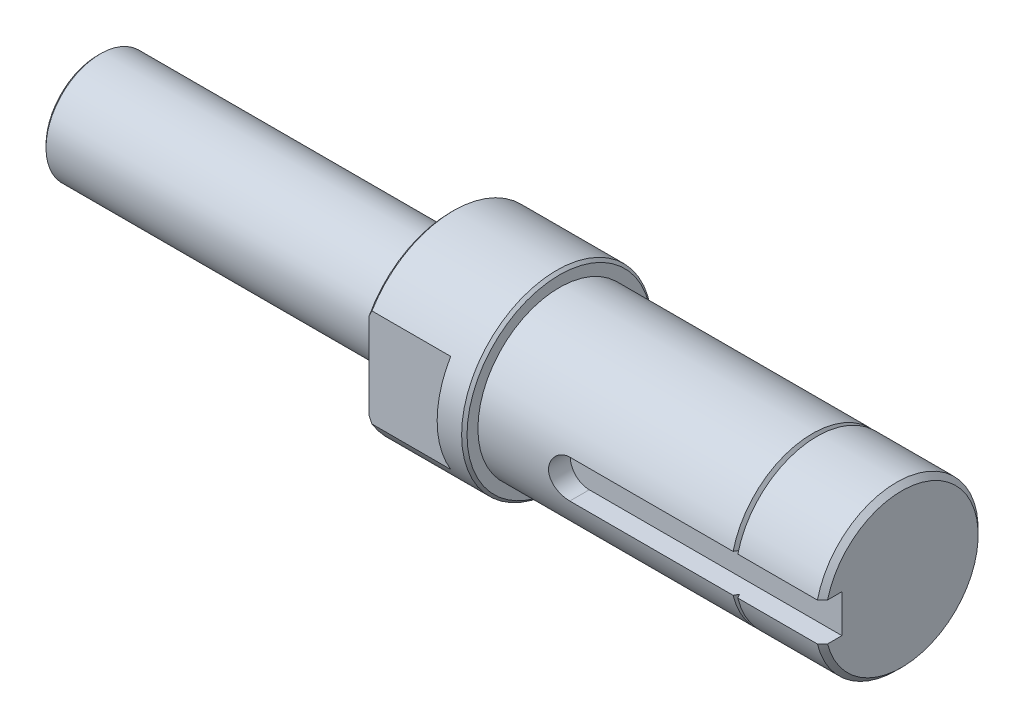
ISO-10303-21;
HEADER;
FILE_DESCRIPTION(('STEP AP214'),'2;1');
FILE_NAME('part.step','',(''),(''),'','','');
FILE_SCHEMA(('AUTOMOTIVE_DESIGN { 1 0 10303 214 1 1 1 1 }'));
ENDSEC;
DATA;
#1=APPLICATION_CONTEXT('core data for automotive mechanical design processes');
#2=APPLICATION_PROTOCOL_DEFINITION('international standard','automotive_design',2000,#1);
#3=PRODUCT_CONTEXT('',#1,'mechanical');
#4=PRODUCT('Part','Part','',(#3));
#5=PRODUCT_RELATED_PRODUCT_CATEGORY('part','',(#4));
#6=PRODUCT_DEFINITION_FORMATION('','',#4);
#7=PRODUCT_DEFINITION_CONTEXT('part definition',#1,'design');
#8=PRODUCT_DEFINITION('design','',#6,#7);
#9=PRODUCT_DEFINITION_SHAPE('','',#8);
#10=(LENGTH_UNIT() NAMED_UNIT(*) SI_UNIT(.MILLI.,.METRE.));
#11=(NAMED_UNIT(*) PLANE_ANGLE_UNIT() SI_UNIT($,.RADIAN.));
#12=(NAMED_UNIT(*) SI_UNIT($,.STERADIAN.) SOLID_ANGLE_UNIT());
#13=UNCERTAINTY_MEASURE_WITH_UNIT(LENGTH_MEASURE(1.E-05),#10,'distance_accuracy_value','');
#14=(GEOMETRIC_REPRESENTATION_CONTEXT(3) GLOBAL_UNCERTAINTY_ASSIGNED_CONTEXT((#13)) GLOBAL_UNIT_ASSIGNED_CONTEXT((#10,
#11,#12)) REPRESENTATION_CONTEXT('',''));
#15=CARTESIAN_POINT('',(0.,0.,0.));
#16=DIRECTION('',(0.,0.,1.));
#17=DIRECTION('',(1.,0.,0.));
#18=AXIS2_PLACEMENT_3D('',#15,#16,#17);
#19=CARTESIAN_POINT('',(83.,0.,0.));
#20=DIRECTION('',(-1.,0.,0.));
#21=DIRECTION('',(0.,0.,1.));
#22=AXIS2_PLACEMENT_3D('',#19,#20,#21);
#23=CYLINDRICAL_SURFACE('',#22,15.);
#24=CARTESIAN_POINT('',(20.,0.,0.));
#25=DIRECTION('',(-1.,0.,0.));
#26=DIRECTION('',(0.,0.,1.));
#27=AXIS2_PLACEMENT_3D('',#24,#25,#26);
#28=CIRCLE('',#27,15.);
#29=CARTESIAN_POINT('',(20.,0.,15.));
#30=VERTEX_POINT('',#29);
#31=EDGE_CURVE('E219',#30,#30,#28,.T.);
#32=ORIENTED_EDGE('',*,*,#31,.F.);
#33=EDGE_LOOP('',(#32));
#34=FACE_BOUND('',#33,.T.);
#35=CARTESIAN_POINT('',(66.5669872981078,0.,0.));
#36=DIRECTION('',(-1.,0.,0.));
#37=DIRECTION('',(0.,0.,1.));
#38=AXIS2_PLACEMENT_3D('',#35,#36,#37);
#39=CIRCLE('',#38,15.);
#40=CARTESIAN_POINT('',(66.5669872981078,3.5,14.5859521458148));
#41=VERTEX_POINT('',#40);
#42=CARTESIAN_POINT('',(66.5669872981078,-3.5,14.5859521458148));
#43=VERTEX_POINT('',#42);
#44=EDGE_CURVE('E182',#41,#43,#39,.T.);
#45=ORIENTED_EDGE('',*,*,#44,.T.);
#46=DIRECTION('',(-1.,0.,0.));
#47=VECTOR('',#46,1.);
#48=CARTESIAN_POINT('',(83.,-3.5,14.5859521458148));
#49=LINE('',#48,#47);
#50=CARTESIAN_POINT('',(36.5,-3.5,14.5859521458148));
#51=VERTEX_POINT('',#50);
#52=EDGE_CURVE('E291',#43,#51,#49,.T.);
#53=ORIENTED_EDGE('',*,*,#52,.T.);
#54=CARTESIAN_POINT('',(36.5,-3.5,14.5859521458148));
#55=CARTESIAN_POINT('',(36.4029930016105,-3.50001098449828,14.5859421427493));
#56=CARTESIAN_POINT('',(36.3059923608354,-3.4959671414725,14.5869196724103));
#57=CARTESIAN_POINT('',(36.1127121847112,-3.47985507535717,14.590775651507));
#58=CARTESIAN_POINT('',(36.016432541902,-3.46778807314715,14.5936538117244));
#59=CARTESIAN_POINT('',(35.8254460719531,-3.43574398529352,14.6012300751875));
#60=CARTESIAN_POINT('',(35.7307367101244,-3.41578127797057,14.6059248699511));
#61=CARTESIAN_POINT('',(35.5434088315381,-3.36812809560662,14.6169869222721));
#62=CARTESIAN_POINT('',(35.4507903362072,-3.34043754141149,14.6233541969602));
#63=CARTESIAN_POINT('',(35.1770439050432,-3.24606757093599,14.6447008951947));
#64=CARTESIAN_POINT('',(34.9998478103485,-3.1680598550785,14.6619327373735));
#65=CARTESIAN_POINT('',(34.6611081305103,-2.98423929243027,14.7004448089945));
#66=CARTESIAN_POINT('',(34.4995678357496,-2.87842061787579,14.7217258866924));
#67=CARTESIAN_POINT('',(34.1935575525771,-2.63980745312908,14.7663931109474));
#68=CARTESIAN_POINT('',(34.0494274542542,-2.50658184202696,14.7898090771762));
#69=CARTESIAN_POINT('',(33.7853394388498,-2.21786171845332,14.8358492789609));
#70=CARTESIAN_POINT('',(33.6653853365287,-2.06236369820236,14.8584733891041));
#71=CARTESIAN_POINT('',(33.4516813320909,-1.73119672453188,14.9007084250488));
#72=CARTESIAN_POINT('',(33.3582643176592,-1.55530745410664,14.9202797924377));
#73=CARTESIAN_POINT('',(33.2024516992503,-1.18980124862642,14.9538625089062));
#74=CARTESIAN_POINT('',(33.1400505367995,-1.00018678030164,14.9678748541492));
#75=CARTESIAN_POINT('',(33.0491203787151,-0.616173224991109,14.9885500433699));
#76=CARTESIAN_POINT('',(33.0200102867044,-0.421918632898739,14.9953388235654));
#77=CARTESIAN_POINT('',(32.9946684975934,-0.0311680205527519,15.0012395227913));
#78=CARTESIAN_POINT('',(32.9984332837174,0.16532775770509,15.0003522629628));
#79=CARTESIAN_POINT('',(33.0383095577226,0.550956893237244,14.9910956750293));
#80=CARTESIAN_POINT('',(33.0737935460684,0.740159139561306,14.9828714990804));
#81=CARTESIAN_POINT('',(33.1750965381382,1.10984488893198,14.9600322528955));
#82=CARTESIAN_POINT('',(33.2409167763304,1.2903280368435,14.9454169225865));
#83=CARTESIAN_POINT('',(33.4015591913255,1.639158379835,14.9112090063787));
#84=CARTESIAN_POINT('',(33.4966130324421,1.8073948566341,14.891576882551));
#85=CARTESIAN_POINT('',(33.7128447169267,2.12574898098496,14.8494785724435));
#86=CARTESIAN_POINT('',(33.8340258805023,2.27586432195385,14.8270120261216));
#87=CARTESIAN_POINT('',(34.1024615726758,2.55744307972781,14.7810806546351));
#88=CARTESIAN_POINT('',(34.2502624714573,2.68838455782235,14.7576047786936));
#89=CARTESIAN_POINT('',(34.5659741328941,2.92375619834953,14.7127850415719));
#90=CARTESIAN_POINT('',(34.7338903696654,3.02817911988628,14.6914417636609));
#91=CARTESIAN_POINT('',(35.0862092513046,3.20786398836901,14.6532641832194));
#92=CARTESIAN_POINT('',(35.2706796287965,3.2829987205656,14.6364496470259));
#93=CARTESIAN_POINT('',(35.554926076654,3.37145680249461,14.6162291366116));
#94=CARTESIAN_POINT('',(35.6509159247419,3.39690005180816,14.6103230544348));
#95=CARTESIAN_POINT('',(35.8447889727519,3.43955343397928,14.6003411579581));
#96=CARTESIAN_POINT('',(35.9426712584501,3.45676744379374,14.5962644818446));
#97=CARTESIAN_POINT('',(36.1172059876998,3.47985101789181,14.590776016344));
#98=CARTESIAN_POINT('',(36.1936287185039,3.48740952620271,14.5889691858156));
#99=CARTESIAN_POINT('',(36.3466980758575,3.49748134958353,14.586556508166));
#100=CARTESIAN_POINT('',(36.4233441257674,3.50000295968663,14.5859486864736));
#101=CARTESIAN_POINT('',(36.5,3.5,14.5859521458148));
#102=B_SPLINE_CURVE_WITH_KNOTS('',3,(#54,#55,#56,#57,#58,#59,#60,#61,#62,#63,#64,#65,#66,#67,
#68,#69,#70,#71,#72,#73,#74,#75,#76,#77,#78,#79,#80,#81,#82,#83,#84,#85,#86,#87,#88,#89,#90,#91,
#92,#93,#94,#95,#96,#97,#98,#99,#100,#101),.UNSPECIFIED.,.F.,.F.,(4,2,2,2,2,2,2,2,2,2,2,2,2,2,2,
2,2,2,2,2,2,2,2,4),(0.,0.290920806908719,0.581797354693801,0.872146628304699,1.16249887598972,
1.74267048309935,2.32296376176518,2.91319936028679,3.50352802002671,4.10096424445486,
4.69829336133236,5.28502883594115,5.87170154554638,6.44701886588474,7.02235959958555,
7.60238257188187,8.18247929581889,8.77622447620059,9.37013160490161,9.96659039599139,
10.2647254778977,10.5627199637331,10.7930041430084,11.0229087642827),.UNSPECIFIED.);
#103=CARTESIAN_POINT('',(36.5,3.5,14.5859521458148));
#104=VERTEX_POINT('',#103);
#105=EDGE_CURVE('E253',#51,#104,#102,.T.);
#106=ORIENTED_EDGE('',*,*,#105,.T.);
#107=DIRECTION('',(-1.,0.,0.));
#108=VECTOR('',#107,1.);
#109=CARTESIAN_POINT('',(83.,3.5,14.5859521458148));
#110=LINE('',#109,#108);
#111=EDGE_CURVE('E198',#104,#41,#110,.F.);
#112=ORIENTED_EDGE('',*,*,#111,.T.);
#113=EDGE_LOOP('',(#45,#53,#106,#112));
#114=FACE_BOUND('',#113,.T.);
#115=ADVANCED_FACE('F40',(#34,#114),#23,.T.);
#116=CARTESIAN_POINT('',(67.4330127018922,0.,0.));
#117=DIRECTION('',(-1.,0.,0.));
#118=DIRECTION('',(0.,0.,1.));
#119=AXIS2_PLACEMENT_3D('',#116,#117,#118);
#120=CIRCLE('',#119,15.);
#121=CARTESIAN_POINT('',(67.4330127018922,3.5,14.5859521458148));
#122=VERTEX_POINT('',#121);
#123=CARTESIAN_POINT('',(67.4330127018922,-3.5,14.5859521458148));
#124=VERTEX_POINT('',#123);
#125=EDGE_CURVE('E64',#122,#124,#120,.T.);
#126=ORIENTED_EDGE('',*,*,#125,.F.);
#127=CARTESIAN_POINT('',(82.08,3.5,14.5859521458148));
#128=VERTEX_POINT('',#127);
#129=EDGE_CURVE('E188',#122,#128,#110,.F.);
#130=ORIENTED_EDGE('',*,*,#129,.T.);
#131=CARTESIAN_POINT('',(82.08,0.,0.));
#132=DIRECTION('',(-1.,0.,0.));
#133=DIRECTION('',(0.,0.,1.));
#134=AXIS2_PLACEMENT_3D('',#131,#132,#133);
#135=CIRCLE('',#134,15.);
#136=CARTESIAN_POINT('',(82.08,-3.5,14.5859521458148));
#137=VERTEX_POINT('',#136);
#138=EDGE_CURVE('E216',#128,#137,#135,.T.);
#139=ORIENTED_EDGE('',*,*,#138,.T.);
#140=EDGE_CURVE('E190',#137,#124,#49,.T.);
#141=ORIENTED_EDGE('',*,*,#140,.T.);
#142=EDGE_LOOP('',(#126,#130,#139,#141));
#143=FACE_BOUND('',#142,.T.);
#144=ADVANCED_FACE('F186',(#143),#23,.T.);
#145=CARTESIAN_POINT('',(83.,3.5,11.));
#146=DIRECTION('',(0.,1.,0.));
#147=DIRECTION('',(0.,0.,1.));
#148=AXIS2_PLACEMENT_3D('',#145,#146,#147);
#149=PLANE('',#148);
#150=CARTESIAN_POINT('',(63.5703695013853,3.5,19.8846167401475));
#151=CARTESIAN_POINT('',(63.8415767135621,3.5,19.4076352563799));
#152=CARTESIAN_POINT('',(64.1125752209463,3.5,18.9305348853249));
#153=CARTESIAN_POINT('',(64.6540169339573,3.5,17.9760198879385));
#154=CARTESIAN_POINT('',(64.9244601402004,3.5,17.4986052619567));
#155=CARTESIAN_POINT('',(65.4646444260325,3.5,16.5434010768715));
#156=CARTESIAN_POINT('',(65.7343855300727,3.5,16.0656115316));
#157=CARTESIAN_POINT('',(66.2729724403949,3.5,15.1095264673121));
#158=CARTESIAN_POINT('',(66.5418182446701,3.5,14.6312309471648));
#159=CARTESIAN_POINT('',(67.0783371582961,3.5,13.6739580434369));
#160=CARTESIAN_POINT('',(67.346010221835,3.5,13.1949806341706));
#161=CARTESIAN_POINT('',(67.8797530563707,3.5,12.236135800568));
#162=CARTESIAN_POINT('',(68.1458228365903,3.5,11.7562683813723));
#163=CARTESIAN_POINT('',(68.5432371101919,3.5,11.0355229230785));
#164=CARTESIAN_POINT('',(68.6754293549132,3.5,10.7951123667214));
#165=CARTESIAN_POINT('',(68.9391277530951,3.5,10.3139156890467));
#166=CARTESIAN_POINT('',(69.0706339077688,3.5,10.073129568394));
#167=CARTESIAN_POINT('',(69.3328189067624,3.5,9.59110095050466));
#168=CARTESIAN_POINT('',(69.4634977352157,3.5,9.34985844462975));
#169=CARTESIAN_POINT('',(69.7238185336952,3.5,8.86681293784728));
#170=CARTESIAN_POINT('',(69.8534604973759,3.5,8.62500993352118));
#171=CARTESIAN_POINT('',(69.982479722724,3.5,8.38287379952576));
#172=B_SPLINE_CURVE_WITH_KNOTS('',3,(#150,#151,#152,#153,#154,#155,#156,#157,#158,#159,#160,
#161,#162,#163,#164,#165,#166,#167,#168,#169,#170,#171),.UNSPECIFIED.,.F.,.F.,(4,2,2,2,2,2,2,2,
2,2,4),(0.,1.6460810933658,3.29216035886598,4.93818151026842,6.58420634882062,8.23029492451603,
9.87637402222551,10.6994455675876,11.5225156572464,12.3456014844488,13.1686923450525),.UNSPECIFIED.);
#173=CARTESIAN_POINT('',(67.,3.5,13.8134897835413));
#174=VERTEX_POINT('',#173);
#175=EDGE_CURVE('E181',#41,#174,#172,.T.);
#176=ORIENTED_EDGE('',*,*,#175,.F.);
#177=ORIENTED_EDGE('',*,*,#111,.F.);
#178=DIRECTION('',(0.,0.,1.));
#179=VECTOR('',#178,1.);
#180=CARTESIAN_POINT('',(36.5,3.5,11.));
#181=LINE('',#180,#179);
#182=CARTESIAN_POINT('',(36.5,3.5,11.));
#183=VERTEX_POINT('',#182);
#184=EDGE_CURVE('E292',#183,#104,#181,.T.);
#185=ORIENTED_EDGE('',*,*,#184,.F.);
#186=DIRECTION('',(-1.,0.,0.));
#187=VECTOR('',#186,1.);
#188=CARTESIAN_POINT('',(83.,3.5,11.));
#189=LINE('',#188,#187);
#190=CARTESIAN_POINT('',(83.,3.5,11.));
#191=VERTEX_POINT('',#190);
#192=EDGE_CURVE('E314',#191,#183,#189,.T.);
#193=ORIENTED_EDGE('',*,*,#192,.F.);
#194=DIRECTION('',(0.,0.,1.));
#195=VECTOR('',#194,1.);
#196=CARTESIAN_POINT('',(83.,3.5,11.));
#197=LINE('',#196,#195);
#198=CARTESIAN_POINT('',(83.,3.5,13.6380497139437));
#199=VERTEX_POINT('',#198);
#200=EDGE_CURVE('E318',#191,#199,#197,.T.);
#201=ORIENTED_EDGE('',*,*,#200,.T.);
#202=CARTESIAN_POINT('',(77.4554523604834,3.5,19.3099163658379));
#203=CARTESIAN_POINT('',(77.9061440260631,3.5,18.8518655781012));
#204=CARTESIAN_POINT('',(78.3565916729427,3.5,18.3935742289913));
#205=CARTESIAN_POINT('',(79.2568372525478,3.5,17.4763554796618));
#206=CARTESIAN_POINT('',(79.706635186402,3.5,17.0174280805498));
#207=CARTESIAN_POINT('',(80.6053976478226,3.5,16.0988048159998));
#208=CARTESIAN_POINT('',(81.0543622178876,3.5,15.639108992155));
#209=CARTESIAN_POINT('',(81.951244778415,3.5,14.7186940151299));
#210=CARTESIAN_POINT('',(82.3991627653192,3.5,14.2579748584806));
#211=CARTESIAN_POINT('',(83.2936384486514,3.5,13.3351657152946));
#212=CARTESIAN_POINT('',(83.7401960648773,3.5,12.8730756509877));
#213=CARTESIAN_POINT('',(84.6314259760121,3.5,11.9470862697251));
#214=CARTESIAN_POINT('',(85.0760982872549,3.5,11.4831869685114));
#215=CARTESIAN_POINT('',(85.7411167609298,3.5,10.785415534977));
#216=CARTESIAN_POINT('',(85.9624643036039,3.5,10.5524978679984));
#217=CARTESIAN_POINT('',(86.4043451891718,3.5,10.0858923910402));
#218=CARTESIAN_POINT('',(86.6248785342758,3.5,9.85220458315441));
#219=CARTESIAN_POINT('',(87.0649625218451,3.5,9.38389188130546));
#220=CARTESIAN_POINT('',(87.2845131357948,3.5,9.14926696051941));
#221=CARTESIAN_POINT('',(87.7223692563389,3.5,8.67885448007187));
#222=CARTESIAN_POINT('',(87.9406747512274,3.5,8.44306690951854));
#223=CARTESIAN_POINT('',(88.1582276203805,3.5,8.20658408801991));
#224=B_SPLINE_CURVE_WITH_KNOTS('',3,(#202,#203,#204,#205,#206,#207,#208,#209,#210,#211,#212,
#213,#214,#215,#216,#217,#218,#219,#220,#221,#222,#223),.UNSPECIFIED.,.F.,.F.,(4,2,2,2,2,2,2,2,
2,2,4),(0.,1.92779746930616,3.85559158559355,5.78328453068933,7.71098402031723,9.63879504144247,
11.5665893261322,12.5305423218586,13.4944926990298,14.4584708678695,15.4224580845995),.UNSPECIFIED.);
#225=EDGE_CURVE('E195',#128,#199,#224,.T.);
#226=ORIENTED_EDGE('',*,*,#225,.F.);
#227=ORIENTED_EDGE('',*,*,#129,.F.);
#228=CARTESIAN_POINT('',(64.017520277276,3.5,8.38287379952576));
#229=CARTESIAN_POINT('',(64.1465395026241,3.5,8.62500993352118));
#230=CARTESIAN_POINT('',(64.2761814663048,3.5,8.86681293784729));
#231=CARTESIAN_POINT('',(64.5365022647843,3.5,9.34985844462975));
#232=CARTESIAN_POINT('',(64.6671810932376,3.5,9.59110095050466));
#233=CARTESIAN_POINT('',(64.9293660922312,3.5,10.073129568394));
#234=CARTESIAN_POINT('',(65.0608722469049,3.5,10.3139156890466));
#235=CARTESIAN_POINT('',(65.3245706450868,3.5,10.7951123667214));
#236=CARTESIAN_POINT('',(65.4567628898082,3.5,11.0355229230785));
#237=CARTESIAN_POINT('',(65.8541771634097,3.5,11.7562683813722));
#238=CARTESIAN_POINT('',(66.1202469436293,3.5,12.236135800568));
#239=CARTESIAN_POINT('',(66.653989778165,3.5,13.1949806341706));
#240=CARTESIAN_POINT('',(66.9216628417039,3.5,13.6739580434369));
#241=CARTESIAN_POINT('',(67.4581817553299,3.5,14.6312309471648));
#242=CARTESIAN_POINT('',(67.7270275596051,3.5,15.1095264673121));
#243=CARTESIAN_POINT('',(68.2656144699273,3.5,16.0656115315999));
#244=CARTESIAN_POINT('',(68.5353555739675,3.5,16.5434010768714));
#245=CARTESIAN_POINT('',(69.0755398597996,3.5,17.4986052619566));
#246=CARTESIAN_POINT('',(69.3459830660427,3.5,17.9760198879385));
#247=CARTESIAN_POINT('',(69.8874247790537,3.5,18.9305348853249));
#248=CARTESIAN_POINT('',(70.1584232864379,3.5,19.4076352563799));
#249=CARTESIAN_POINT('',(70.4296304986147,3.5,19.8846167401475));
#250=B_SPLINE_CURVE_WITH_KNOTS('',3,(#228,#229,#230,#231,#232,#233,#234,#235,#236,#237,#238,
#239,#240,#241,#242,#243,#244,#245,#246,#247,#248,#249),.UNSPECIFIED.,.F.,.F.,(4,2,2,2,2,2,2,2,
2,2,4),(0.,0.823090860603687,1.64617668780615,2.46924677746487,3.29231832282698,
4.93839742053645,6.58448599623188,8.23051083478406,9.87653198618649,11.5226112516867,
13.1686923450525),.UNSPECIFIED.);
#251=EDGE_CURVE('E173',#174,#122,#250,.T.);
#252=ORIENTED_EDGE('',*,*,#251,.F.);
#253=EDGE_LOOP('',(#176,#177,#185,#193,#201,#226,#227,#252));
#254=FACE_BOUND('',#253,.T.);
#255=ADVANCED_FACE('F193',(#254),#149,.F.);
#256=CARTESIAN_POINT('',(36.5,-3.5,11.));
#257=DIRECTION('',(0.,-1.,0.));
#258=DIRECTION('',(0.,0.,-1.));
#259=AXIS2_PLACEMENT_3D('',#256,#257,#258);
#260=PLANE('',#259);
#261=CARTESIAN_POINT('',(69.982479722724,-3.5,8.38287379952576));
#262=CARTESIAN_POINT('',(69.8534604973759,-3.5,8.62500993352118));
#263=CARTESIAN_POINT('',(69.7238185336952,-3.5,8.86681293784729));
#264=CARTESIAN_POINT('',(69.4634977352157,-3.5,9.34985844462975));
#265=CARTESIAN_POINT('',(69.3328189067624,-3.5,9.59110095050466));
#266=CARTESIAN_POINT('',(69.0706339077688,-3.5,10.073129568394));
#267=CARTESIAN_POINT('',(68.9391277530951,-3.5,10.3139156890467));
#268=CARTESIAN_POINT('',(68.6754293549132,-3.5,10.7951123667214));
#269=CARTESIAN_POINT('',(68.5432371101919,-3.5,11.0355229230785));
#270=CARTESIAN_POINT('',(68.1458228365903,-3.5,11.7562683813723));
#271=CARTESIAN_POINT('',(67.8797530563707,-3.5,12.236135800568));
#272=CARTESIAN_POINT('',(67.346010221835,-3.5,13.1949806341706));
#273=CARTESIAN_POINT('',(67.0783371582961,-3.5,13.6739580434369));
#274=CARTESIAN_POINT('',(66.5418182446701,-3.5,14.6312309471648));
#275=CARTESIAN_POINT('',(66.2729724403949,-3.5,15.1095264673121));
#276=CARTESIAN_POINT('',(65.7343855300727,-3.5,16.0656115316));
#277=CARTESIAN_POINT('',(65.4646444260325,-3.5,16.5434010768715));
#278=CARTESIAN_POINT('',(64.9244601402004,-3.5,17.4986052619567));
#279=CARTESIAN_POINT('',(64.6540169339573,-3.5,17.9760198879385));
#280=CARTESIAN_POINT('',(64.1125752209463,-3.5,18.9305348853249));
#281=CARTESIAN_POINT('',(63.8415767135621,-3.5,19.4076352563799));
#282=CARTESIAN_POINT('',(63.5703695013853,-3.5,19.8846167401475));
#283=B_SPLINE_CURVE_WITH_KNOTS('',3,(#261,#262,#263,#264,#265,#266,#267,#268,#269,#270,#271,
#272,#273,#274,#275,#276,#277,#278,#279,#280,#281,#282),.UNSPECIFIED.,.F.,.F.,(4,2,2,2,2,2,2,2,
2,2,4),(0.,0.823090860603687,1.64617668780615,2.46924677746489,3.29231832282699,
4.93839742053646,6.58448599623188,8.23051083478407,9.87653198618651,11.5226112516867,
13.1686923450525),.UNSPECIFIED.);
#284=CARTESIAN_POINT('',(67.,-3.5,13.8134897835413));
#285=VERTEX_POINT('',#284);
#286=EDGE_CURVE('E11',#285,#43,#283,.T.);
#287=ORIENTED_EDGE('',*,*,#286,.F.);
#288=CARTESIAN_POINT('',(70.4296304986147,-3.5,19.8846167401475));
#289=CARTESIAN_POINT('',(70.1584232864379,-3.5,19.4076352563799));
#290=CARTESIAN_POINT('',(69.8874247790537,-3.5,18.9305348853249));
#291=CARTESIAN_POINT('',(69.3459830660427,-3.5,17.9760198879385));
#292=CARTESIAN_POINT('',(69.0755398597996,-3.5,17.4986052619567));
#293=CARTESIAN_POINT('',(68.5353555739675,-3.5,16.5434010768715));
#294=CARTESIAN_POINT('',(68.2656144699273,-3.5,16.0656115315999));
#295=CARTESIAN_POINT('',(67.7270275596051,-3.5,15.1095264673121));
#296=CARTESIAN_POINT('',(67.4581817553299,-3.5,14.6312309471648));
#297=CARTESIAN_POINT('',(66.9216628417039,-3.5,13.6739580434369));
#298=CARTESIAN_POINT('',(66.653989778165,-3.5,13.1949806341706));
#299=CARTESIAN_POINT('',(66.1202469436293,-3.5,12.236135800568));
#300=CARTESIAN_POINT('',(65.8541771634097,-3.5,11.7562683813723));
#301=CARTESIAN_POINT('',(65.4567628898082,-3.5,11.0355229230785));
#302=CARTESIAN_POINT('',(65.3245706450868,-3.5,10.7951123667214));
#303=CARTESIAN_POINT('',(65.0608722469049,-3.5,10.3139156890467));
#304=CARTESIAN_POINT('',(64.9293660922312,-3.5,10.073129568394));
#305=CARTESIAN_POINT('',(64.6671810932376,-3.5,9.59110095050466));
#306=CARTESIAN_POINT('',(64.5365022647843,-3.5,9.34985844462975));
#307=CARTESIAN_POINT('',(64.2761814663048,-3.5,8.86681293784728));
#308=CARTESIAN_POINT('',(64.1465395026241,-3.5,8.62500993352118));
#309=CARTESIAN_POINT('',(64.017520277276,-3.5,8.38287379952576));
#310=B_SPLINE_CURVE_WITH_KNOTS('',3,(#288,#289,#290,#291,#292,#293,#294,#295,#296,#297,#298,
#299,#300,#301,#302,#303,#304,#305,#306,#307,#308,#309),.UNSPECIFIED.,.F.,.F.,(4,2,2,2,2,2,2,2,
2,2,4),(0.,1.6460810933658,3.29216035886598,4.93818151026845,6.58420634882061,8.23029492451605,
9.8763740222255,10.6994455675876,11.5225156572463,12.3456014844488,13.1686923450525),.UNSPECIFIED.);
#311=EDGE_CURVE('E54',#124,#285,#310,.T.);
#312=ORIENTED_EDGE('',*,*,#311,.F.);
#313=ORIENTED_EDGE('',*,*,#140,.F.);
#314=CARTESIAN_POINT('',(88.1582276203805,-3.5,8.20658408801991));
#315=CARTESIAN_POINT('',(87.9406747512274,-3.5,8.44306690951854));
#316=CARTESIAN_POINT('',(87.7223692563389,-3.5,8.67885448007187));
#317=CARTESIAN_POINT('',(87.2845131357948,-3.5,9.14926696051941));
#318=CARTESIAN_POINT('',(87.0649625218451,-3.5,9.38389188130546));
#319=CARTESIAN_POINT('',(86.6248785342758,-3.5,9.85220458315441));
#320=CARTESIAN_POINT('',(86.4043451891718,-3.5,10.0858923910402));
#321=CARTESIAN_POINT('',(85.9624643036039,-3.5,10.5524978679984));
#322=CARTESIAN_POINT('',(85.7411167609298,-3.5,10.785415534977));
#323=CARTESIAN_POINT('',(85.0760982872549,-3.5,11.4831869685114));
#324=CARTESIAN_POINT('',(84.6314259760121,-3.5,11.9470862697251));
#325=CARTESIAN_POINT('',(83.7401960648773,-3.5,12.8730756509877));
#326=CARTESIAN_POINT('',(83.2936384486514,-3.5,13.3351657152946));
#327=CARTESIAN_POINT('',(82.3991627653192,-3.5,14.2579748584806));
#328=CARTESIAN_POINT('',(81.951244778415,-3.5,14.7186940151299));
#329=CARTESIAN_POINT('',(81.0543622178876,-3.5,15.639108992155));
#330=CARTESIAN_POINT('',(80.6053976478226,-3.5,16.0988048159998));
#331=CARTESIAN_POINT('',(79.706635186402,-3.5,17.0174280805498));
#332=CARTESIAN_POINT('',(79.2568372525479,-3.5,17.4763554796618));
#333=CARTESIAN_POINT('',(78.3565916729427,-3.5,18.3935742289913));
#334=CARTESIAN_POINT('',(77.9061440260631,-3.5,18.8518655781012));
#335=CARTESIAN_POINT('',(77.4554523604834,-3.5,19.3099163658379));
#336=B_SPLINE_CURVE_WITH_KNOTS('',3,(#314,#315,#316,#317,#318,#319,#320,#321,#322,#323,#324,
#325,#326,#327,#328,#329,#330,#331,#332,#333,#334,#335),.UNSPECIFIED.,.F.,.F.,(4,2,2,2,2,2,2,2,
2,2,4),(0.,0.963987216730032,1.92796538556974,2.89191576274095,3.85586875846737,
5.78366304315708,7.71147406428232,9.63917355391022,11.566866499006,13.4946606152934,
15.4224580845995),.UNSPECIFIED.);
#337=CARTESIAN_POINT('',(83.,-3.5,13.6380497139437));
#338=VERTEX_POINT('',#337);
#339=EDGE_CURVE('E284',#338,#137,#336,.T.);
#340=ORIENTED_EDGE('',*,*,#339,.F.);
#341=DIRECTION('',(0.,0.,1.));
#342=VECTOR('',#341,1.);
#343=CARTESIAN_POINT('',(83.,-3.5,11.));
#344=LINE('',#343,#342);
#345=CARTESIAN_POINT('',(83.,-3.5,11.));
#346=VERTEX_POINT('',#345);
#347=EDGE_CURVE('E313',#346,#338,#344,.T.);
#348=ORIENTED_EDGE('',*,*,#347,.F.);
#349=DIRECTION('',(1.,0.,0.));
#350=VECTOR('',#349,1.);
#351=CARTESIAN_POINT('',(36.5,-3.5,11.));
#352=LINE('',#351,#350);
#353=CARTESIAN_POINT('',(36.5,-3.5,11.));
#354=VERTEX_POINT('',#353);
#355=EDGE_CURVE('E310',#354,#346,#352,.T.);
#356=ORIENTED_EDGE('',*,*,#355,.F.);
#357=DIRECTION('',(0.,0.,1.));
#358=VECTOR('',#357,1.);
#359=CARTESIAN_POINT('',(36.5,-3.5,11.));
#360=LINE('',#359,#358);
#361=EDGE_CURVE('E293',#354,#51,#360,.T.);
#362=ORIENTED_EDGE('',*,*,#361,.T.);
#363=ORIENTED_EDGE('',*,*,#52,.F.);
#364=EDGE_LOOP('',(#287,#312,#313,#340,#348,#356,#362,#363));
#365=FACE_BOUND('',#364,.T.);
#366=ADVANCED_FACE('F273',(#365),#260,.F.);
#367=CARTESIAN_POINT('',(0.,9.99999999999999,0.));
#368=DIRECTION('',(1.,0.,0.));
#369=DIRECTION('',(0.,0.,-1.));
#370=AXIS2_PLACEMENT_3D('',#367,#368,#369);
#371=PLANE('',#370);
#372=CARTESIAN_POINT('',(0.,0.,0.));
#373=DIRECTION('',(-1.,0.,0.));
#374=DIRECTION('',(0.,0.,1.));
#375=AXIS2_PLACEMENT_3D('',#372,#373,#374);
#376=CIRCLE('',#375,10.);
#377=CARTESIAN_POINT('',(0.,0.,10.));
#378=VERTEX_POINT('',#377);
#379=EDGE_CURVE('E241',#378,#378,#376,.T.);
#380=ORIENTED_EDGE('',*,*,#379,.F.);
#381=EDGE_LOOP('',(#380));
#382=FACE_BOUND('',#381,.T.);
#383=DIRECTION('',(0.,1.,0.));
#384=VECTOR('',#383,1.);
#385=CARTESIAN_POINT('',(0.,-35.,15.));
#386=LINE('',#385,#384);
#387=CARTESIAN_POINT('',(0.,-7.99999999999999,15.));
#388=VERTEX_POINT('',#387);
#389=CARTESIAN_POINT('',(0.,7.99999999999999,15.));
#390=VERTEX_POINT('',#389);
#391=EDGE_CURVE('E463',#388,#390,#386,.T.);
#392=ORIENTED_EDGE('',*,*,#391,.T.);
#393=CARTESIAN_POINT('',(0.,0.,0.));
#394=DIRECTION('',(-1.,0.,0.));
#395=DIRECTION('',(0.,0.,1.));
#396=AXIS2_PLACEMENT_3D('',#393,#394,#395);
#397=CIRCLE('',#396,17.);
#398=CARTESIAN_POINT('',(0.,7.99999999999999,-15.));
#399=VERTEX_POINT('',#398);
#400=EDGE_CURVE('E237',#390,#399,#397,.T.);
#401=ORIENTED_EDGE('',*,*,#400,.T.);
#402=DIRECTION('',(0.,-1.,0.));
#403=VECTOR('',#402,1.);
#404=CARTESIAN_POINT('',(0.,35.,-15.));
#405=LINE('',#404,#403);
#406=CARTESIAN_POINT('',(0.,-7.99999999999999,-15.));
#407=VERTEX_POINT('',#406);
#408=EDGE_CURVE('E460',#399,#407,#405,.T.);
#409=ORIENTED_EDGE('',*,*,#408,.T.);
#410=EDGE_CURVE('E236',#407,#388,#397,.T.);
#411=ORIENTED_EDGE('',*,*,#410,.T.);
#412=EDGE_LOOP('',(#392,#401,#409,#411));
#413=FACE_BOUND('',#412,.T.);
#414=ADVANCED_FACE('F399',(#382,#413),#371,.F.);
#415=CARTESIAN_POINT('',(0.5,0.,0.));
#416=DIRECTION('',(1.,0.,0.));
#417=DIRECTION('',(0.,0.,-1.));
#418=AXIS2_PLACEMENT_3D('',#415,#416,#417);
#419=CONICAL_SURFACE('',#418,17.5,0.785398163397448);
#420=CARTESIAN_POINT('',(21.5023427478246,35.4602650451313,15.));
#421=CARTESIAN_POINT('',(21.0173389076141,34.9336378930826,15.));
#422=CARTESIAN_POINT('',(20.5332062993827,34.4062063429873,15.));
#423=CARTESIAN_POINT('',(19.5669590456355,33.3494908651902,15.));
#424=CARTESIAN_POINT('',(19.0848444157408,32.8202069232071,15.));
#425=CARTESIAN_POINT('',(18.1228076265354,31.7594315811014,15.));
#426=CARTESIAN_POINT('',(17.642885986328,31.2279397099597,15.));
#427=CARTESIAN_POINT('',(16.6856957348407,30.1625732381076,15.));
#428=CARTESIAN_POINT('',(16.2084271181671,29.6286986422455,15.));
#429=CARTESIAN_POINT('',(15.2540668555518,28.5549598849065,15.));
#430=CARTESIAN_POINT('',(14.7769939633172,28.0150790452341,15.));
#431=CARTESIAN_POINT('',(13.8264835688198,26.9321265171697,15.));
#432=CARTESIAN_POINT('',(13.3530460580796,26.3890548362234,15.));
#433=CARTESIAN_POINT('',(12.4105070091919,25.2992637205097,15.));
#434=CARTESIAN_POINT('',(11.9414049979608,24.7525446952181,15.));
#435=CARTESIAN_POINT('',(11.0082964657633,23.6547739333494,15.));
#436=CARTESIAN_POINT('',(10.5442899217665,23.1037222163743,15.));
#437=CARTESIAN_POINT('',(9.70821267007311,22.0995665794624,15.));
#438=CARTESIAN_POINT('',(9.33510695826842,21.6473248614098,15.));
#439=CARTESIAN_POINT('',(8.5936589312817,20.7389550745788,15.));
#440=CARTESIAN_POINT('',(8.22531657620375,20.2828270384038,15.));
#441=CARTESIAN_POINT('',(7.49415824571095,19.365958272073,15.));
#442=CARTESIAN_POINT('',(7.13134376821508,18.9052163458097,15.));
#443=CARTESIAN_POINT('',(6.41242709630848,17.9785219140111,15.));
#444=CARTESIAN_POINT('',(6.05632485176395,17.5125694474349,15.));
#445=CARTESIAN_POINT('',(5.35258668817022,16.5751005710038,15.));
#446=CARTESIAN_POINT('',(5.00494191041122,16.1035908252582,15.));
#447=CARTESIAN_POINT('',(4.31944967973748,15.1534548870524,15.));
#448=CARTESIAN_POINT('',(3.98160261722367,14.6748284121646,15.));
#449=CARTESIAN_POINT('',(3.31812709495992,13.709457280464,15.));
#450=CARTESIAN_POINT('',(2.99249340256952,13.2227162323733,15.));
#451=CARTESIAN_POINT('',(2.35627907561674,12.2395282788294,15.));
#452=CARTESIAN_POINT('',(2.0456967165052,11.7430824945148,15.));
#453=CARTESIAN_POINT('',(1.44617000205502,10.7433597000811,15.));
#454=CARTESIAN_POINT('',(1.15705451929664,10.2401859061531,15.));
#455=CARTESIAN_POINT('',(0.60231979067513,9.22087395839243,15.));
#456=CARTESIAN_POINT('',(0.336703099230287,8.70473440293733,15.));
#457=CARTESIAN_POINT('',(-0.164291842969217,7.65844656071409,15.));
#458=CARTESIAN_POINT('',(-0.399698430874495,7.12831197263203,15.));
#459=CARTESIAN_POINT('',(-0.832376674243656,6.05261751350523,15.));
#460=CARTESIAN_POINT('',(-1.02965939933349,5.50706217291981,15.));
#461=CARTESIAN_POINT('',(-1.33936203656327,4.51947974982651,15.));
#462=CARTESIAN_POINT('',(-1.46090796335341,4.08033088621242,15.));
#463=CARTESIAN_POINT('',(-1.66977785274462,3.19390847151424,15.));
#464=CARTESIAN_POINT('',(-1.75710635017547,2.74663600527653,15.));
#465=CARTESIAN_POINT('',(-1.89316013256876,1.8475262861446,15.));
#466=CARTESIAN_POINT('',(-1.94199878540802,1.39570643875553,15.));
#467=CARTESIAN_POINT('',(-1.9988274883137,0.48947925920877,15.));
#468=CARTESIAN_POINT('',(-2.00681913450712,0.0350720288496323,15.));
#469=CARTESIAN_POINT('',(-1.98147708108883,-0.873143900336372,15.));
#470=CARTESIAN_POINT('',(-1.94809118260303,-1.32695111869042,15.));
#471=CARTESIAN_POINT('',(-1.84179435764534,-2.2298755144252,15.));
#472=CARTESIAN_POINT('',(-1.76888010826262,-2.67899229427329,15.));
#473=CARTESIAN_POINT('',(-1.58695891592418,-3.57117607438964,15.));
#474=CARTESIAN_POINT('',(-1.47784287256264,-4.01422051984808,15.));
#475=CARTESIAN_POINT('',(-1.22826116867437,-4.89127914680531,15.));
#476=CARTESIAN_POINT('',(-1.08779500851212,-5.32529318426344,15.));
#477=CARTESIAN_POINT('',(-0.753506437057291,-6.25861031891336,15.));
#478=CARTESIAN_POINT('',(-0.554650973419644,-6.75609812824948,15.));
#479=CARTESIAN_POINT('',(-0.127366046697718,-7.73831424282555,15.));
#480=CARTESIAN_POINT('',(0.101076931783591,-8.22303659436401,15.));
#481=CARTESIAN_POINT('',(0.581981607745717,-9.18140393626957,15.));
#482=CARTESIAN_POINT('',(0.834485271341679,-9.6550277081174,15.));
#483=CARTESIAN_POINT('',(1.35838633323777,-10.5915511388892,15.));
#484=CARTESIAN_POINT('',(1.62978108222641,-11.0544522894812,15.));
#485=CARTESIAN_POINT('',(2.19113901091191,-11.9764403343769,15.));
#486=CARTESIAN_POINT('',(2.48128587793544,-12.4354148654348,15.));
#487=CARTESIAN_POINT('',(3.07419700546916,-13.3451248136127,15.));
#488=CARTESIAN_POINT('',(3.3769615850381,-13.7958600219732,15.));
#489=CARTESIAN_POINT('',(3.99247527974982,-14.6897557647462,15.));
#490=CARTESIAN_POINT('',(4.30521379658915,-15.1329236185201,15.));
#491=CARTESIAN_POINT('',(4.93917017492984,-16.013131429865,15.));
#492=CARTESIAN_POINT('',(5.26038795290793,-16.4501714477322,15.));
#493=CARTESIAN_POINT('',(5.89787338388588,-17.3028829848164,15.));
#494=CARTESIAN_POINT('',(6.21388435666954,-17.7187467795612,15.));
#495=CARTESIAN_POINT('',(6.85145837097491,-18.546201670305,15.));
#496=CARTESIAN_POINT('',(7.17302150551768,-18.9577926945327,15.));
#497=CARTESIAN_POINT('',(7.8208971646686,-19.7772568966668,15.));
#498=CARTESIAN_POINT('',(8.14720998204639,-20.18512984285,15.));
#499=CARTESIAN_POINT('',(8.80390620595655,-20.9975879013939,15.));
#500=CARTESIAN_POINT('',(9.13428965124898,-21.402172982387,15.));
#501=CARTESIAN_POINT('',(10.1311653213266,-22.6121614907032,15.));
#502=CARTESIAN_POINT('',(10.8029271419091,-23.4132249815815,15.));
#503=CARTESIAN_POINT('',(12.1571278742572,-25.00627385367,15.));
#504=CARTESIAN_POINT('',(12.8395669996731,-25.7982590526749,15.));
#505=CARTESIAN_POINT('',(13.8529461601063,-26.9617896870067,15.));
#506=CARTESIAN_POINT('',(14.1806601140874,-27.3361514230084,15.));
#507=CARTESIAN_POINT('',(14.8377824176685,-28.0833767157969,15.));
#508=CARTESIAN_POINT('',(15.1671907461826,-28.4562402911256,15.));
#509=CARTESIAN_POINT('',(16.1577074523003,-29.5728210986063,15.));
#510=CARTESIAN_POINT('',(16.8210965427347,-30.3145157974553,15.));
#511=CARTESIAN_POINT('',(18.1518182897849,-31.7923516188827,15.));
#512=CARTESIAN_POINT('',(18.8191435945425,-32.5284993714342,15.));
#513=CARTESIAN_POINT('',(20.1578782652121,-33.9970274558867,15.));
#514=CARTESIAN_POINT('',(20.8292874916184,-34.7294079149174,15.));
#515=CARTESIAN_POINT('',(21.5023427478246,-35.4602650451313,15.));
#516=B_SPLINE_CURVE_WITH_KNOTS('',3,(#420,#421,#422,#423,#424,#425,#426,#427,#428,#429,#430,
#431,#432,#433,#434,#435,#436,#437,#438,#439,#440,#441,#442,#443,#444,#445,#446,#447,#448,#449,
#450,#451,#452,#453,#454,#455,#456,#457,#458,#459,#460,#461,#462,#463,#464,#465,#466,#467,#468,
#469,#470,#471,#472,#473,#474,#475,#476,#477,#478,#479,#480,#481,#482,#483,#484,#485,#486,#487,
#488,#489,#490,#491,#492,#493,#494,#495,#496,#497,#498,#499,#500,#501,#502,#503,#504,#505,#506,
#507,#508,#509,#510,#511,#512,#513,#514,#515),.UNSPECIFIED.,.F.,.F.,(4,2,2,2,2,2,2,2,2,2,2,2,2,
2,2,2,2,2,2,2,2,2,2,2,2,2,2,2,2,2,2,2,2,2,2,2,2,2,2,2,2,2,2,2,2,2,2,4),(0.,2.14781033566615,
4.29563726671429,6.44394869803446,8.59225576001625,10.7536370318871,12.9150132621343,
15.0761507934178,17.2372785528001,18.9961075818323,20.7549218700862,22.5142045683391,
24.2734741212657,26.0308138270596,27.7882234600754,29.5448713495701,31.301317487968,
33.0417864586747,34.7824443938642,36.5214574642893,38.259964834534,39.6257770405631,
40.9914081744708,42.3530017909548,43.7145422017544,45.0778019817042,46.441176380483,
47.808697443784,49.1762403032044,50.7822986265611,52.38909319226,53.9987434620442,
55.6081684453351,57.2368994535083,58.8656716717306,60.4927673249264,62.1198469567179,
63.6867170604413,65.2536134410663,66.820606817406,68.3876151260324,71.523828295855,
74.6601043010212,76.1527113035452,77.6452997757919,80.6305269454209,83.6113045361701,
86.5919808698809),.UNSPECIFIED.);
#517=CARTESIAN_POINT('',(0.5,9.01387818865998,15.));
#518=VERTEX_POINT('',#517);
#519=EDGE_CURVE('E385',#518,#390,#516,.T.);
#520=ORIENTED_EDGE('',*,*,#519,.F.);
#521=CARTESIAN_POINT('',(0.5,0.,0.));
#522=DIRECTION('',(-1.,0.,0.));
#523=DIRECTION('',(0.,0.,1.));
#524=AXIS2_PLACEMENT_3D('',#521,#522,#523);
#525=CIRCLE('',#524,17.5);
#526=CARTESIAN_POINT('',(0.5,9.01387818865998,-15.));
#527=VERTEX_POINT('',#526);
#528=EDGE_CURVE('E232',#518,#527,#525,.T.);
#529=ORIENTED_EDGE('',*,*,#528,.T.);
#530=CARTESIAN_POINT('',(21.5023427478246,-35.4602650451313,-15.));
#531=CARTESIAN_POINT('',(21.0173389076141,-34.9336378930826,-15.));
#532=CARTESIAN_POINT('',(20.5332062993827,-34.4062063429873,-15.));
#533=CARTESIAN_POINT('',(19.5669590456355,-33.3494908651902,-15.));
#534=CARTESIAN_POINT('',(19.0848444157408,-32.8202069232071,-15.));
#535=CARTESIAN_POINT('',(18.1228076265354,-31.7594315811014,-15.));
#536=CARTESIAN_POINT('',(17.642885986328,-31.2279397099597,-15.));
#537=CARTESIAN_POINT('',(16.6856957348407,-30.1625732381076,-15.));
#538=CARTESIAN_POINT('',(16.208427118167,-29.6286986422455,-15.));
#539=CARTESIAN_POINT('',(15.2540668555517,-28.5549598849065,-15.));
#540=CARTESIAN_POINT('',(14.7769939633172,-28.0150790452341,-15.));
#541=CARTESIAN_POINT('',(13.8264835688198,-26.9321265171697,-15.));
#542=CARTESIAN_POINT('',(13.3530460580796,-26.3890548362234,-15.));
#543=CARTESIAN_POINT('',(12.4105070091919,-25.2992637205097,-15.));
#544=CARTESIAN_POINT('',(11.9414049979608,-24.7525446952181,-15.));
#545=CARTESIAN_POINT('',(11.0082964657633,-23.6547739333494,-15.));
#546=CARTESIAN_POINT('',(10.5442899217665,-23.1037222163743,-15.));
#547=CARTESIAN_POINT('',(9.70821267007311,-22.0995665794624,-15.));
#548=CARTESIAN_POINT('',(9.33510695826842,-21.6473248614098,-15.));
#549=CARTESIAN_POINT('',(8.5936589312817,-20.7389550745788,-15.));
#550=CARTESIAN_POINT('',(8.22531657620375,-20.2828270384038,-15.));
#551=CARTESIAN_POINT('',(7.49415824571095,-19.365958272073,-15.));
#552=CARTESIAN_POINT('',(7.13134376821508,-18.9052163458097,-15.));
#553=CARTESIAN_POINT('',(6.41242709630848,-17.9785219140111,-15.));
#554=CARTESIAN_POINT('',(6.05632485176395,-17.5125694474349,-15.));
#555=CARTESIAN_POINT('',(5.35258668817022,-16.5751005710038,-15.));
#556=CARTESIAN_POINT('',(5.00494191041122,-16.1035908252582,-15.));
#557=CARTESIAN_POINT('',(4.31944967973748,-15.1534548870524,-15.));
#558=CARTESIAN_POINT('',(3.98160261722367,-14.6748284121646,-15.));
#559=CARTESIAN_POINT('',(3.31812709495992,-13.709457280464,-15.));
#560=CARTESIAN_POINT('',(2.99249340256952,-13.2227162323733,-15.));
#561=CARTESIAN_POINT('',(2.35627907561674,-12.2395282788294,-15.));
#562=CARTESIAN_POINT('',(2.0456967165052,-11.7430824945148,-15.));
#563=CARTESIAN_POINT('',(1.44617000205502,-10.7433597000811,-15.));
#564=CARTESIAN_POINT('',(1.15705451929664,-10.2401859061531,-15.));
#565=CARTESIAN_POINT('',(0.60231979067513,-9.22087395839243,-15.));
#566=CARTESIAN_POINT('',(0.336703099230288,-8.70473440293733,-15.));
#567=CARTESIAN_POINT('',(-0.164291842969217,-7.65844656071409,-15.));
#568=CARTESIAN_POINT('',(-0.399698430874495,-7.12831197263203,-15.));
#569=CARTESIAN_POINT('',(-0.832376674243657,-6.05261751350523,-15.));
#570=CARTESIAN_POINT('',(-1.02965939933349,-5.50706217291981,-15.));
#571=CARTESIAN_POINT('',(-1.33936203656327,-4.51947974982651,-15.));
#572=CARTESIAN_POINT('',(-1.46090796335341,-4.08033088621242,-15.));
#573=CARTESIAN_POINT('',(-1.66977785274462,-3.19390847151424,-15.));
#574=CARTESIAN_POINT('',(-1.75710635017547,-2.74663600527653,-15.));
#575=CARTESIAN_POINT('',(-1.89316013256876,-1.8475262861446,-15.));
#576=CARTESIAN_POINT('',(-1.94199878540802,-1.39570643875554,-15.));
#577=CARTESIAN_POINT('',(-1.9988274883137,-0.489479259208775,-15.));
#578=CARTESIAN_POINT('',(-2.00681913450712,-0.0350720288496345,-15.));
#579=CARTESIAN_POINT('',(-1.98147708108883,0.873143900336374,-15.));
#580=CARTESIAN_POINT('',(-1.94809118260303,1.32695111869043,-15.));
#581=CARTESIAN_POINT('',(-1.84179435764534,2.22987551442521,-15.));
#582=CARTESIAN_POINT('',(-1.76888010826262,2.67899229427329,-15.));
#583=CARTESIAN_POINT('',(-1.58695891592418,3.57117607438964,-15.));
#584=CARTESIAN_POINT('',(-1.47784287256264,4.01422051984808,-15.));
#585=CARTESIAN_POINT('',(-1.22826116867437,4.8912791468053,-15.));
#586=CARTESIAN_POINT('',(-1.08779500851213,5.32529318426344,-15.));
#587=CARTESIAN_POINT('',(-0.753506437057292,6.25861031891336,-15.));
#588=CARTESIAN_POINT('',(-0.554650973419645,6.75609812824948,-15.));
#589=CARTESIAN_POINT('',(-0.127366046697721,7.73831424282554,-15.));
#590=CARTESIAN_POINT('',(0.101076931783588,8.223036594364,-15.));
#591=CARTESIAN_POINT('',(0.581981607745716,9.18140393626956,-15.));
#592=CARTESIAN_POINT('',(0.83448527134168,9.6550277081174,-15.));
#593=CARTESIAN_POINT('',(1.35838633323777,10.5915511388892,-15.));
#594=CARTESIAN_POINT('',(1.62978108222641,11.0544522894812,-15.));
#595=CARTESIAN_POINT('',(2.19113901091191,11.9764403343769,-15.));
#596=CARTESIAN_POINT('',(2.48128587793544,12.4354148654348,-15.));
#597=CARTESIAN_POINT('',(3.07419700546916,13.3451248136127,-15.));
#598=CARTESIAN_POINT('',(3.3769615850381,13.7958600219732,-15.));
#599=CARTESIAN_POINT('',(3.99247527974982,14.6897557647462,-15.));
#600=CARTESIAN_POINT('',(4.30521379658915,15.1329236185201,-15.));
#601=CARTESIAN_POINT('',(4.93917017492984,16.013131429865,-15.));
#602=CARTESIAN_POINT('',(5.26038795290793,16.4501714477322,-15.));
#603=CARTESIAN_POINT('',(5.89787338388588,17.3028829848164,-15.));
#604=CARTESIAN_POINT('',(6.21388435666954,17.7187467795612,-15.));
#605=CARTESIAN_POINT('',(6.85145837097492,18.546201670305,-15.));
#606=CARTESIAN_POINT('',(7.17302150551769,18.9577926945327,-15.));
#607=CARTESIAN_POINT('',(7.8208971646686,19.7772568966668,-15.));
#608=CARTESIAN_POINT('',(8.1472099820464,20.18512984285,-15.));
#609=CARTESIAN_POINT('',(8.80390620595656,20.9975879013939,-15.));
#610=CARTESIAN_POINT('',(9.13428965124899,21.402172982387,-15.));
#611=CARTESIAN_POINT('',(10.1311653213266,22.6121614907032,-15.));
#612=CARTESIAN_POINT('',(10.8029271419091,23.4132249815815,-15.));
#613=CARTESIAN_POINT('',(12.1571278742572,25.00627385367,-15.));
#614=CARTESIAN_POINT('',(12.8395669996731,25.7982590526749,-15.));
#615=CARTESIAN_POINT('',(13.8529461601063,26.9617896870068,-15.));
#616=CARTESIAN_POINT('',(14.1806601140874,27.3361514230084,-15.));
#617=CARTESIAN_POINT('',(14.8377824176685,28.0833767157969,-15.));
#618=CARTESIAN_POINT('',(15.1671907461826,28.4562402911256,-15.));
#619=CARTESIAN_POINT('',(16.1577074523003,29.5728210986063,-15.));
#620=CARTESIAN_POINT('',(16.8210965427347,30.3145157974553,-15.));
#621=CARTESIAN_POINT('',(18.1518182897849,31.7923516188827,-15.));
#622=CARTESIAN_POINT('',(18.8191435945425,32.5284993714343,-15.));
#623=CARTESIAN_POINT('',(20.1578782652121,33.9970274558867,-15.));
#624=CARTESIAN_POINT('',(20.8292874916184,34.7294079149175,-15.));
#625=CARTESIAN_POINT('',(21.5023427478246,35.4602650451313,-15.));
#626=B_SPLINE_CURVE_WITH_KNOTS('',3,(#530,#531,#532,#533,#534,#535,#536,#537,#538,#539,#540,
#541,#542,#543,#544,#545,#546,#547,#548,#549,#550,#551,#552,#553,#554,#555,#556,#557,#558,#559,
#560,#561,#562,#563,#564,#565,#566,#567,#568,#569,#570,#571,#572,#573,#574,#575,#576,#577,#578,
#579,#580,#581,#582,#583,#584,#585,#586,#587,#588,#589,#590,#591,#592,#593,#594,#595,#596,#597,
#598,#599,#600,#601,#602,#603,#604,#605,#606,#607,#608,#609,#610,#611,#612,#613,#614,#615,#616,
#617,#618,#619,#620,#621,#622,#623,#624,#625),.UNSPECIFIED.,.F.,.F.,(4,2,2,2,2,2,2,2,2,2,2,2,2,
2,2,2,2,2,2,2,2,2,2,2,2,2,2,2,2,2,2,2,2,2,2,2,2,2,2,2,2,2,2,2,2,2,2,4),(0.,2.14781033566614,
4.29563726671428,6.44394869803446,8.59225576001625,10.7536370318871,12.9150132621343,
15.0761507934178,17.2372785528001,18.9961075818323,20.7549218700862,22.5142045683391,
24.2734741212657,26.0308138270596,27.7882234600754,29.5448713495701,31.301317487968,
33.0417864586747,34.7824443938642,36.5214574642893,38.259964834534,39.6257770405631,
40.9914081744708,42.3530017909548,43.7145422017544,45.0778019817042,46.441176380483,
47.808697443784,49.1762403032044,50.7822986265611,52.3890931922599,53.9987434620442,
55.6081684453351,57.2368994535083,58.8656716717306,60.4927673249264,62.1198469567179,
63.6867170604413,65.2536134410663,66.820606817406,68.3876151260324,71.523828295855,
74.6601043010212,76.1527113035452,77.6452997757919,80.6305269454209,83.6113045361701,
86.5919808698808),.UNSPECIFIED.);
#627=EDGE_CURVE('E387',#399,#527,#626,.T.);
#628=ORIENTED_EDGE('',*,*,#627,.F.);
#629=ORIENTED_EDGE('',*,*,#400,.F.);
#630=EDGE_LOOP('',(#520,#529,#628,#629));
#631=FACE_BOUND('',#630,.T.);
#632=ADVANCED_FACE('F393',(#631),#419,.T.);
#633=CARTESIAN_POINT('',(0.5,-9.01387818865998,15.));
#634=VERTEX_POINT('',#633);
#635=EDGE_CURVE('E377',#388,#634,#516,.T.);
#636=ORIENTED_EDGE('',*,*,#635,.F.);
#637=ORIENTED_EDGE('',*,*,#410,.F.);
#638=CARTESIAN_POINT('',(0.5,-9.01387818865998,-15.));
#639=VERTEX_POINT('',#638);
#640=EDGE_CURVE('E386',#639,#407,#626,.T.);
#641=ORIENTED_EDGE('',*,*,#640,.F.);
#642=EDGE_CURVE('E231',#639,#634,#525,.T.);
#643=ORIENTED_EDGE('',*,*,#642,.T.);
#644=EDGE_LOOP('',(#636,#637,#641,#643));
#645=FACE_BOUND('',#644,.T.);
#646=ADVANCED_FACE('F398',(#645),#419,.T.);
#647=CARTESIAN_POINT('',(83.,0.,0.));
#648=DIRECTION('',(-1.,0.,0.));
#649=DIRECTION('',(0.,0.,1.));
#650=AXIS2_PLACEMENT_3D('',#647,#648,#649);
#651=CYLINDRICAL_SURFACE('',#650,17.5);
#652=CARTESIAN_POINT('',(19.5,0.,0.));
#653=DIRECTION('',(-1.,0.,0.));
#654=DIRECTION('',(0.,0.,1.));
#655=AXIS2_PLACEMENT_3D('',#652,#653,#654);
#656=CIRCLE('',#655,17.5);
#657=CARTESIAN_POINT('',(19.5,0.,17.5));
#658=VERTEX_POINT('',#657);
#659=EDGE_CURVE('E227',#658,#658,#656,.T.);
#660=ORIENTED_EDGE('',*,*,#659,.T.);
#661=EDGE_LOOP('',(#660));
#662=FACE_BOUND('',#661,.T.);
#663=DIRECTION('',(-1.,0.,0.));
#664=VECTOR('',#663,1.);
#665=CARTESIAN_POINT('',(83.,9.01387818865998,15.));
#666=LINE('',#665,#664);
#667=CARTESIAN_POINT('',(15.,9.01387818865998,15.));
#668=VERTEX_POINT('',#667);
#669=EDGE_CURVE('E335',#668,#518,#666,.T.);
#670=ORIENTED_EDGE('',*,*,#669,.F.);
#671=CARTESIAN_POINT('',(15.,0.,0.));
#672=DIRECTION('',(1.,0.,0.));
#673=DIRECTION('',(0.,0.,-1.));
#674=AXIS2_PLACEMENT_3D('',#671,#672,#673);
#675=CIRCLE('',#674,17.5);
#676=CARTESIAN_POINT('',(15.,-9.01387818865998,15.));
#677=VERTEX_POINT('',#676);
#678=EDGE_CURVE('E445',#668,#677,#675,.T.);
#679=ORIENTED_EDGE('',*,*,#678,.T.);
#680=DIRECTION('',(-1.,0.,0.));
#681=VECTOR('',#680,1.);
#682=CARTESIAN_POINT('',(83.,-9.01387818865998,15.));
#683=LINE('',#682,#681);
#684=EDGE_CURVE('E337',#634,#677,#683,.F.);
#685=ORIENTED_EDGE('',*,*,#684,.F.);
#686=ORIENTED_EDGE('',*,*,#642,.F.);
#687=DIRECTION('',(-1.,0.,0.));
#688=VECTOR('',#687,1.);
#689=CARTESIAN_POINT('',(83.,-9.01387818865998,-15.));
#690=LINE('',#689,#688);
#691=CARTESIAN_POINT('',(15.,-9.01387818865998,-15.));
#692=VERTEX_POINT('',#691);
#693=EDGE_CURVE('E456',#692,#639,#690,.T.);
#694=ORIENTED_EDGE('',*,*,#693,.F.);
#695=CARTESIAN_POINT('',(15.,9.01387818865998,-15.));
#696=VERTEX_POINT('',#695);
#697=EDGE_CURVE('E262',#692,#696,#675,.T.);
#698=ORIENTED_EDGE('',*,*,#697,.T.);
#699=DIRECTION('',(-1.,0.,0.));
#700=VECTOR('',#699,1.);
#701=CARTESIAN_POINT('',(83.,9.01387818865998,-15.));
#702=LINE('',#701,#700);
#703=EDGE_CURVE('E453',#527,#696,#702,.F.);
#704=ORIENTED_EDGE('',*,*,#703,.F.);
#705=ORIENTED_EDGE('',*,*,#528,.F.);
#706=EDGE_LOOP('',(#670,#679,#685,#686,#694,#698,#704,#705));
#707=FACE_BOUND('',#706,.T.);
#708=ADVANCED_FACE('F401',(#662,#707),#651,.T.);
#709=CARTESIAN_POINT('',(-65.,0.,0.));
#710=DIRECTION('',(1.,0.,0.));
#711=DIRECTION('',(0.,0.,-1.));
#712=AXIS2_PLACEMENT_3D('',#709,#710,#711);
#713=PLANE('',#712);
#714=CARTESIAN_POINT('',(-65.,0.,0.));
#715=DIRECTION('',(-1.,0.,0.));
#716=DIRECTION('',(0.,0.,1.));
#717=AXIS2_PLACEMENT_3D('',#714,#715,#716);
#718=CIRCLE('',#717,9.5);
#719=CARTESIAN_POINT('',(-65.,0.,9.5));
#720=VERTEX_POINT('',#719);
#721=EDGE_CURVE('E249',#720,#720,#718,.T.);
#722=ORIENTED_EDGE('',*,*,#721,.T.);
#723=EDGE_LOOP('',(#722));
#724=FACE_BOUND('',#723,.T.);
#725=ADVANCED_FACE('F42',(#724),#713,.F.);
#726=CARTESIAN_POINT('',(-64.5,0.,0.));
#727=DIRECTION('',(1.,0.,0.));
#728=DIRECTION('',(0.,0.,-1.));
#729=AXIS2_PLACEMENT_3D('',#726,#727,#728);
#730=CONICAL_SURFACE('',#729,10.,0.785398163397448);
#731=ORIENTED_EDGE('',*,*,#721,.F.);
#732=EDGE_LOOP('',(#731));
#733=FACE_BOUND('',#732,.T.);
#734=CARTESIAN_POINT('',(-64.5,0.,0.));
#735=DIRECTION('',(-1.,0.,0.));
#736=DIRECTION('',(0.,0.,1.));
#737=AXIS2_PLACEMENT_3D('',#734,#735,#736);
#738=CIRCLE('',#737,10.);
#739=CARTESIAN_POINT('',(-64.5,0.,10.));
#740=VERTEX_POINT('',#739);
#741=EDGE_CURVE('E245',#740,#740,#738,.T.);
#742=ORIENTED_EDGE('',*,*,#741,.T.);
#743=EDGE_LOOP('',(#742));
#744=FACE_BOUND('',#743,.T.);
#745=ADVANCED_FACE('F410',(#733,#744),#730,.T.);
#746=CARTESIAN_POINT('',(83.,0.,0.));
#747=DIRECTION('',(-1.,0.,0.));
#748=DIRECTION('',(0.,0.,1.));
#749=AXIS2_PLACEMENT_3D('',#746,#747,#748);
#750=CYLINDRICAL_SURFACE('',#749,10.);
#751=ORIENTED_EDGE('',*,*,#741,.F.);
#752=EDGE_LOOP('',(#751));
#753=FACE_BOUND('',#752,.T.);
#754=ORIENTED_EDGE('',*,*,#379,.T.);
#755=EDGE_LOOP('',(#754));
#756=FACE_BOUND('',#755,.T.);
#757=ADVANCED_FACE('F407',(#753,#756),#750,.T.);
#758=CARTESIAN_POINT('',(20.,0.,0.));
#759=DIRECTION('',(-1.,0.,0.));
#760=DIRECTION('',(0.,0.,1.));
#761=AXIS2_PLACEMENT_3D('',#758,#759,#760);
#762=CONICAL_SURFACE('',#761,17.,0.785398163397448);
#763=ORIENTED_EDGE('',*,*,#659,.F.);
#764=EDGE_LOOP('',(#763));
#765=FACE_BOUND('',#764,.T.);
#766=CARTESIAN_POINT('',(20.,0.,0.));
#767=DIRECTION('',(-1.,0.,0.));
#768=DIRECTION('',(0.,0.,1.));
#769=AXIS2_PLACEMENT_3D('',#766,#767,#768);
#770=CIRCLE('',#769,17.);
#771=CARTESIAN_POINT('',(20.,0.,17.));
#772=VERTEX_POINT('',#771);
#773=EDGE_CURVE('E223',#772,#772,#770,.T.);
#774=ORIENTED_EDGE('',*,*,#773,.T.);
#775=EDGE_LOOP('',(#774));
#776=FACE_BOUND('',#775,.T.);
#777=ADVANCED_FACE('F409',(#765,#776),#762,.T.);
#778=CARTESIAN_POINT('',(20.,17.,0.));
#779=DIRECTION('',(-1.,0.,0.));
#780=DIRECTION('',(0.,0.,1.));
#781=AXIS2_PLACEMENT_3D('',#778,#779,#780);
#782=PLANE('',#781);
#783=ORIENTED_EDGE('',*,*,#773,.F.);
#784=EDGE_LOOP('',(#783));
#785=FACE_BOUND('',#784,.T.);
#786=ORIENTED_EDGE('',*,*,#31,.T.);
#787=EDGE_LOOP('',(#786));
#788=FACE_BOUND('',#787,.T.);
#789=ADVANCED_FACE('F280',(#785,#788),#782,.F.);
#790=CARTESIAN_POINT('',(83.,0.,0.));
#791=DIRECTION('',(-1.,0.,0.));
#792=DIRECTION('',(0.,0.,1.));
#793=AXIS2_PLACEMENT_3D('',#790,#791,#792);
#794=CONICAL_SURFACE('',#793,14.08,0.785398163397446);
#795=ORIENTED_EDGE('',*,*,#138,.F.);
#796=ORIENTED_EDGE('',*,*,#225,.T.);
#797=CARTESIAN_POINT('',(83.,0.,0.));
#798=DIRECTION('',(-1.,0.,0.));
#799=DIRECTION('',(0.,0.,1.));
#800=AXIS2_PLACEMENT_3D('',#797,#798,#799);
#801=CIRCLE('',#800,14.08);
#802=EDGE_CURVE('E203',#199,#338,#801,.T.);
#803=ORIENTED_EDGE('',*,*,#802,.T.);
#804=ORIENTED_EDGE('',*,*,#339,.T.);
#805=EDGE_LOOP('',(#795,#796,#803,#804));
#806=FACE_BOUND('',#805,.T.);
#807=ADVANCED_FACE('F276',(#806),#794,.T.);
#808=CARTESIAN_POINT('',(83.,14.08,0.));
#809=DIRECTION('',(-1.,0.,0.));
#810=DIRECTION('',(0.,0.,1.));
#811=AXIS2_PLACEMENT_3D('',#808,#809,#810);
#812=PLANE('',#811);
#813=ORIENTED_EDGE('',*,*,#802,.F.);
#814=ORIENTED_EDGE('',*,*,#200,.F.);
#815=DIRECTION('',(0.,1.,0.));
#816=VECTOR('',#815,1.);
#817=CARTESIAN_POINT('',(83.,-3.5,11.));
#818=LINE('',#817,#816);
#819=EDGE_CURVE('E321',#346,#191,#818,.T.);
#820=ORIENTED_EDGE('',*,*,#819,.F.);
#821=ORIENTED_EDGE('',*,*,#347,.T.);
#822=EDGE_LOOP('',(#813,#814,#820,#821));
#823=FACE_BOUND('',#822,.T.);
#824=ADVANCED_FACE('F271',(#823),#812,.F.);
#825=CARTESIAN_POINT('',(36.5,0.,11.));
#826=DIRECTION('',(0.,0.,1.));
#827=DIRECTION('',(1.,0.,0.));
#828=AXIS2_PLACEMENT_3D('',#825,#826,#827);
#829=CYLINDRICAL_SURFACE('',#828,3.5);
#830=ORIENTED_EDGE('',*,*,#361,.F.);
#831=CARTESIAN_POINT('',(36.5,0.,11.));
#832=DIRECTION('',(0.,0.,1.));
#833=DIRECTION('',(1.,0.,0.));
#834=AXIS2_PLACEMENT_3D('',#831,#832,#833);
#835=CIRCLE('',#834,3.5);
#836=EDGE_CURVE('E392',#183,#354,#835,.T.);
#837=ORIENTED_EDGE('',*,*,#836,.F.);
#838=ORIENTED_EDGE('',*,*,#184,.T.);
#839=ORIENTED_EDGE('',*,*,#105,.F.);
#840=EDGE_LOOP('',(#830,#837,#838,#839));
#841=FACE_BOUND('',#840,.T.);
#842=ADVANCED_FACE('F266',(#841),#829,.F.);
#843=CARTESIAN_POINT('',(36.5,0.,11.));
#844=DIRECTION('',(0.,0.,1.));
#845=DIRECTION('',(1.,0.,0.));
#846=AXIS2_PLACEMENT_3D('',#843,#844,#845);
#847=PLANE('',#846);
#848=ORIENTED_EDGE('',*,*,#836,.T.);
#849=ORIENTED_EDGE('',*,*,#355,.T.);
#850=ORIENTED_EDGE('',*,*,#819,.T.);
#851=ORIENTED_EDGE('',*,*,#192,.T.);
#852=EDGE_LOOP('',(#848,#849,#850,#851));
#853=FACE_BOUND('',#852,.T.);
#854=ADVANCED_FACE('F270',(#853),#847,.T.);
#855=CARTESIAN_POINT('',(15.,0.,0.));
#856=DIRECTION('',(1.,0.,0.));
#857=DIRECTION('',(0.,0.,-1.));
#858=AXIS2_PLACEMENT_3D('',#855,#856,#857);
#859=PLANE('',#858);
#860=DIRECTION('',(0.,-1.,0.));
#861=VECTOR('',#860,1.);
#862=CARTESIAN_POINT('',(15.,35.,-15.));
#863=LINE('',#862,#861);
#864=EDGE_CURVE('E459',#696,#692,#863,.T.);
#865=ORIENTED_EDGE('',*,*,#864,.F.);
#866=ORIENTED_EDGE('',*,*,#697,.F.);
#867=EDGE_LOOP('',(#865,#866));
#868=FACE_BOUND('',#867,.T.);
#869=ADVANCED_FACE('F367',(#868),#859,.F.);
#870=CARTESIAN_POINT('',(15.,35.,-15.));
#871=DIRECTION('',(0.,0.,-1.));
#872=DIRECTION('',(-1.,0.,0.));
#873=AXIS2_PLACEMENT_3D('',#870,#871,#872);
#874=PLANE('',#873);
#875=ORIENTED_EDGE('',*,*,#640,.T.);
#876=ORIENTED_EDGE('',*,*,#408,.F.);
#877=ORIENTED_EDGE('',*,*,#627,.T.);
#878=ORIENTED_EDGE('',*,*,#703,.T.);
#879=ORIENTED_EDGE('',*,*,#864,.T.);
#880=ORIENTED_EDGE('',*,*,#693,.T.);
#881=EDGE_LOOP('',(#875,#876,#877,#878,#879,#880));
#882=FACE_BOUND('',#881,.T.);
#883=ADVANCED_FACE('F373',(#882),#874,.T.);
#884=CARTESIAN_POINT('',(15.,-35.,15.));
#885=DIRECTION('',(0.,0.,1.));
#886=DIRECTION('',(1.,0.,0.));
#887=AXIS2_PLACEMENT_3D('',#884,#885,#886);
#888=PLANE('',#887);
#889=ORIENTED_EDGE('',*,*,#519,.T.);
#890=ORIENTED_EDGE('',*,*,#391,.F.);
#891=ORIENTED_EDGE('',*,*,#635,.T.);
#892=ORIENTED_EDGE('',*,*,#684,.T.);
#893=DIRECTION('',(0.,1.,0.));
#894=VECTOR('',#893,1.);
#895=CARTESIAN_POINT('',(15.,-35.,15.));
#896=LINE('',#895,#894);
#897=EDGE_CURVE('E74',#677,#668,#896,.T.);
#898=ORIENTED_EDGE('',*,*,#897,.T.);
#899=ORIENTED_EDGE('',*,*,#669,.T.);
#900=EDGE_LOOP('',(#889,#890,#891,#892,#898,#899));
#901=FACE_BOUND('',#900,.T.);
#902=ADVANCED_FACE('F368',(#901),#888,.T.);
#903=ORIENTED_EDGE('',*,*,#897,.F.);
#904=ORIENTED_EDGE('',*,*,#678,.F.);
#905=EDGE_LOOP('',(#903,#904));
#906=FACE_BOUND('',#905,.T.);
#907=ADVANCED_FACE('F372',(#906),#859,.F.);
#908=CARTESIAN_POINT('',(66.5669872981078,0.,0.));
#909=DIRECTION('',(-1.,0.,0.));
#910=DIRECTION('',(0.,0.,1.));
#911=AXIS2_PLACEMENT_3D('',#908,#909,#910);
#912=CONICAL_SURFACE('',#911,15.,1.0471975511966);
#913=ORIENTED_EDGE('',*,*,#175,.T.);
#914=CARTESIAN_POINT('',(67.,0.,0.));
#915=DIRECTION('',(-1.,0.,0.));
#916=DIRECTION('',(0.,0.,1.));
#917=AXIS2_PLACEMENT_3D('',#914,#915,#916);
#918=CIRCLE('',#917,14.25);
#919=EDGE_CURVE('E176',#174,#285,#918,.T.);
#920=ORIENTED_EDGE('',*,*,#919,.T.);
#921=ORIENTED_EDGE('',*,*,#286,.T.);
#922=ORIENTED_EDGE('',*,*,#44,.F.);
#923=EDGE_LOOP('',(#913,#920,#921,#922));
#924=FACE_BOUND('',#923,.T.);
#925=ADVANCED_FACE('F346',(#924),#912,.T.);
#926=CARTESIAN_POINT('',(67.,0.,0.));
#927=DIRECTION('',(1.,0.,0.));
#928=DIRECTION('',(0.,0.,-1.));
#929=AXIS2_PLACEMENT_3D('',#926,#927,#928);
#930=CONICAL_SURFACE('',#929,14.25,1.0471975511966);
#931=ORIENTED_EDGE('',*,*,#251,.T.);
#932=ORIENTED_EDGE('',*,*,#125,.T.);
#933=ORIENTED_EDGE('',*,*,#311,.T.);
#934=ORIENTED_EDGE('',*,*,#919,.F.);
#935=EDGE_LOOP('',(#931,#932,#933,#934));
#936=FACE_BOUND('',#935,.T.);
#937=ADVANCED_FACE('F174',(#936),#930,.T.);
#938=CLOSED_SHELL('',(#115,#144,#255,#366,#414,#632,#646,#708,#725,#745,#757,#777,#789,#807,
#824,#842,#854,#869,#883,#902,#907,#925,#937));
#939=MANIFOLD_SOLID_BREP('B2',#938);
#940=ADVANCED_BREP_SHAPE_REPRESENTATION('',(#18,#939),#14);
#941=SHAPE_DEFINITION_REPRESENTATION(#9,#940);
ENDSEC;
END-ISO-10303-21;
